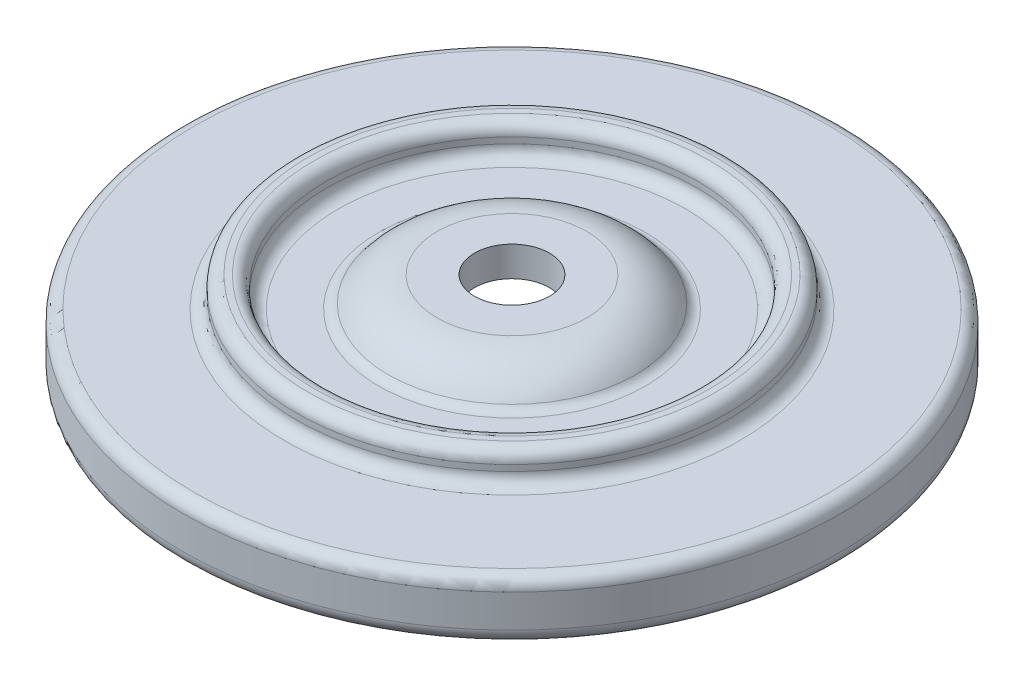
ISO-10303-21;
HEADER;
FILE_DESCRIPTION(('STEP AP214'),'2;1');
FILE_NAME('part.step','',(''),(''),'','','');
FILE_SCHEMA(('AUTOMOTIVE_DESIGN { 1 0 10303 214 1 1 1 1 }'));
ENDSEC;
DATA;
#1=APPLICATION_CONTEXT('core data for automotive mechanical design processes');
#2=APPLICATION_PROTOCOL_DEFINITION('international standard','automotive_design',2000,#1);
#3=PRODUCT_CONTEXT('',#1,'mechanical');
#4=PRODUCT('Part','Part','',(#3));
#5=PRODUCT_RELATED_PRODUCT_CATEGORY('part','',(#4));
#6=PRODUCT_DEFINITION_FORMATION('','',#4);
#7=PRODUCT_DEFINITION_CONTEXT('part definition',#1,'design');
#8=PRODUCT_DEFINITION('design','',#6,#7);
#9=PRODUCT_DEFINITION_SHAPE('','',#8);
#10=(LENGTH_UNIT() NAMED_UNIT(*) SI_UNIT(.MILLI.,.METRE.));
#11=(NAMED_UNIT(*) PLANE_ANGLE_UNIT() SI_UNIT($,.RADIAN.));
#12=(NAMED_UNIT(*) SI_UNIT($,.STERADIAN.) SOLID_ANGLE_UNIT());
#13=UNCERTAINTY_MEASURE_WITH_UNIT(LENGTH_MEASURE(1.E-05),#10,'distance_accuracy_value','');
#14=(GEOMETRIC_REPRESENTATION_CONTEXT(3) GLOBAL_UNCERTAINTY_ASSIGNED_CONTEXT((#13)) GLOBAL_UNIT_ASSIGNED_CONTEXT((#10,
#11,#12)) REPRESENTATION_CONTEXT('',''));
#15=CARTESIAN_POINT('',(0.,0.,0.));
#16=DIRECTION('',(0.,0.,1.));
#17=DIRECTION('',(1.,0.,0.));
#18=AXIS2_PLACEMENT_3D('',#15,#16,#17);
#19=CARTESIAN_POINT('',(13.97,-3.80999999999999,0.));
#20=DIRECTION('',(0.,1.,0.));
#21=DIRECTION('',(0.,0.,1.));
#22=AXIS2_PLACEMENT_3D('',#19,#20,#21);
#23=PLANE('',#22);
#24=CARTESIAN_POINT('',(0.,-3.80999999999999,0.));
#25=DIRECTION('',(0.,1.,0.));
#26=DIRECTION('',(0.,0.,1.));
#27=AXIS2_PLACEMENT_3D('',#24,#25,#26);
#28=CIRCLE('',#27,13.208);
#29=CARTESIAN_POINT('',(0.,-3.80999999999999,13.208));
#30=VERTEX_POINT('',#29);
#31=EDGE_CURVE('E82',#30,#30,#28,.T.);
#32=ORIENTED_EDGE('',*,*,#31,.T.);
#33=EDGE_LOOP('',(#32));
#34=FACE_BOUND('',#33,.T.);
#35=CARTESIAN_POINT('',(0.,-3.80999999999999,0.));
#36=DIRECTION('',(0.,1.,0.));
#37=DIRECTION('',(0.,0.,1.));
#38=AXIS2_PLACEMENT_3D('',#35,#36,#37);
#39=CIRCLE('',#38,13.335);
#40=CARTESIAN_POINT('',(0.,-3.80999999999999,13.335));
#41=VERTEX_POINT('',#40);
#42=EDGE_CURVE('E88',#41,#41,#39,.F.);
#43=ORIENTED_EDGE('',*,*,#42,.T.);
#44=EDGE_LOOP('',(#43));
#45=FACE_BOUND('',#44,.T.);
#46=ADVANCED_FACE('F26',(#34,#45),#23,.F.);
#47=CARTESIAN_POINT('',(0.,0.,0.));
#48=DIRECTION('',(0.,-1.,0.));
#49=DIRECTION('',(0.,0.,-1.));
#50=AXIS2_PLACEMENT_3D('',#47,#48,#49);
#51=PLANE('',#50);
#52=CARTESIAN_POINT('',(0.,0.,0.));
#53=DIRECTION('',(0.,-1.,0.));
#54=DIRECTION('',(0.,0.,-1.));
#55=AXIS2_PLACEMENT_3D('',#52,#53,#54);
#56=CIRCLE('',#55,8.636);
#57=CARTESIAN_POINT('',(0.,0.,-8.636));
#58=VERTEX_POINT('',#57);
#59=EDGE_CURVE('E49',#58,#58,#56,.F.);
#60=ORIENTED_EDGE('',*,*,#59,.T.);
#61=EDGE_LOOP('',(#60));
#62=FACE_BOUND('',#61,.T.);
#63=CARTESIAN_POINT('',(0.,0.,0.));
#64=DIRECTION('',(0.,-1.,0.));
#65=DIRECTION('',(0.,0.,-1.));
#66=AXIS2_PLACEMENT_3D('',#63,#64,#65);
#67=CIRCLE('',#66,8.382);
#68=CARTESIAN_POINT('',(0.,0.,-8.382));
#69=VERTEX_POINT('',#68);
#70=EDGE_CURVE('E52',#69,#69,#67,.T.);
#71=ORIENTED_EDGE('',*,*,#70,.T.);
#72=EDGE_LOOP('',(#71));
#73=FACE_BOUND('',#72,.T.);
#74=ADVANCED_FACE('F28',(#62,#73),#51,.F.);
#75=CARTESIAN_POINT('',(0.,0.,0.));
#76=DIRECTION('',(0.,-1.,0.));
#77=DIRECTION('',(0.,0.,-1.));
#78=AXIS2_PLACEMENT_3D('',#75,#76,#77);
#79=CYLINDRICAL_SURFACE('',#78,9.144);
#80=CARTESIAN_POINT('',(0.,-0.762,0.));
#81=DIRECTION('',(0.,-1.,0.));
#82=DIRECTION('',(0.,0.,-1.));
#83=AXIS2_PLACEMENT_3D('',#80,#81,#82);
#84=CIRCLE('',#83,9.144);
#85=CARTESIAN_POINT('',(0.,-0.762,-9.144));
#86=VERTEX_POINT('',#85);
#87=EDGE_CURVE('E58',#86,#86,#84,.F.);
#88=ORIENTED_EDGE('',*,*,#87,.T.);
#89=EDGE_LOOP('',(#88));
#90=FACE_BOUND('',#89,.T.);
#91=CARTESIAN_POINT('',(0.,-0.508,0.));
#92=DIRECTION('',(0.,-1.,0.));
#93=DIRECTION('',(0.,0.,-1.));
#94=AXIS2_PLACEMENT_3D('',#91,#92,#93);
#95=CIRCLE('',#94,9.144);
#96=CARTESIAN_POINT('',(0.,-0.508,-9.144));
#97=VERTEX_POINT('',#96);
#98=EDGE_CURVE('E61',#97,#97,#95,.T.);
#99=ORIENTED_EDGE('',*,*,#98,.T.);
#100=EDGE_LOOP('',(#99));
#101=FACE_BOUND('',#100,.T.);
#102=ADVANCED_FACE('F126',(#90,#101),#79,.T.);
#103=CARTESIAN_POINT('',(9.144,-1.27,0.));
#104=DIRECTION('',(0.,-1.,0.));
#105=DIRECTION('',(0.,0.,-1.));
#106=AXIS2_PLACEMENT_3D('',#103,#104,#105);
#107=PLANE('',#106);
#108=CARTESIAN_POINT('',(0.,-1.27,0.));
#109=DIRECTION('',(0.,-1.,0.));
#110=DIRECTION('',(0.,0.,-1.));
#111=AXIS2_PLACEMENT_3D('',#108,#109,#110);
#112=CIRCLE('',#111,9.652);
#113=CARTESIAN_POINT('',(0.,-1.27,-9.652));
#114=VERTEX_POINT('',#113);
#115=EDGE_CURVE('E64',#114,#114,#112,.T.);
#116=ORIENTED_EDGE('',*,*,#115,.T.);
#117=EDGE_LOOP('',(#116));
#118=FACE_BOUND('',#117,.T.);
#119=CARTESIAN_POINT('',(0.,-1.27,0.));
#120=DIRECTION('',(0.,-1.,0.));
#121=DIRECTION('',(0.,0.,-1.));
#122=AXIS2_PLACEMENT_3D('',#119,#120,#121);
#123=CIRCLE('',#122,13.462);
#124=CARTESIAN_POINT('',(0.,-1.27,-13.462));
#125=VERTEX_POINT('',#124);
#126=EDGE_CURVE('E67',#125,#125,#123,.F.);
#127=ORIENTED_EDGE('',*,*,#126,.T.);
#128=EDGE_LOOP('',(#127));
#129=FACE_BOUND('',#128,.T.);
#130=ADVANCED_FACE('F137',(#118,#129),#107,.F.);
#131=CARTESIAN_POINT('',(0.,0.,0.));
#132=DIRECTION('',(0.,-1.,0.));
#133=DIRECTION('',(0.,0.,-1.));
#134=AXIS2_PLACEMENT_3D('',#131,#132,#133);
#135=CYLINDRICAL_SURFACE('',#134,13.97);
#136=CARTESIAN_POINT('',(0.,-1.778,0.));
#137=DIRECTION('',(0.,-1.,0.));
#138=DIRECTION('',(0.,0.,-1.));
#139=AXIS2_PLACEMENT_3D('',#136,#137,#138);
#140=CIRCLE('',#139,13.97);
#141=CARTESIAN_POINT('',(0.,-1.778,-13.97));
#142=VERTEX_POINT('',#141);
#143=EDGE_CURVE('E55',#142,#142,#140,.T.);
#144=ORIENTED_EDGE('',*,*,#143,.T.);
#145=EDGE_LOOP('',(#144));
#146=FACE_BOUND('',#145,.T.);
#147=CARTESIAN_POINT('',(0.,-3.17499999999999,0.));
#148=DIRECTION('',(0.,1.,0.));
#149=DIRECTION('',(0.,0.,1.));
#150=AXIS2_PLACEMENT_3D('',#147,#148,#149);
#151=CIRCLE('',#150,13.97);
#152=CARTESIAN_POINT('',(0.,-3.17499999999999,13.97));
#153=VERTEX_POINT('',#152);
#154=EDGE_CURVE('E85',#153,#153,#151,.T.);
#155=ORIENTED_EDGE('',*,*,#154,.T.);
#156=EDGE_LOOP('',(#155));
#157=FACE_BOUND('',#156,.T.);
#158=ADVANCED_FACE('F134',(#146,#157),#135,.T.);
#159=CARTESIAN_POINT('',(0.,-2.54,0.));
#160=DIRECTION('',(0.,1.,0.));
#161=DIRECTION('',(0.,0.,1.));
#162=AXIS2_PLACEMENT_3D('',#159,#160,#161);
#163=TOROIDAL_SURFACE('',#162,3.175,2.54);
#164=CARTESIAN_POINT('',(0.,-1.05833333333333,0.));
#165=DIRECTION('',(0.,-1.,0.));
#166=DIRECTION('',(0.,0.,-1.));
#167=AXIS2_PLACEMENT_3D('',#164,#165,#166);
#168=CIRCLE('',#167,5.23807146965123);
#169=CARTESIAN_POINT('',(0.,-1.05833333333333,-5.23807146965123));
#170=VERTEX_POINT('',#169);
#171=EDGE_CURVE('E10',#170,#170,#168,.F.);
#172=ORIENTED_EDGE('',*,*,#171,.T.);
#173=EDGE_LOOP('',(#172));
#174=FACE_BOUND('',#173,.T.);
#175=CARTESIAN_POINT('',(0.,0.,0.));
#176=DIRECTION('',(0.,1.,0.));
#177=DIRECTION('',(0.,0.,1.));
#178=AXIS2_PLACEMENT_3D('',#175,#176,#177);
#179=CIRCLE('',#178,3.175);
#180=CARTESIAN_POINT('',(0.,0.,3.175));
#181=VERTEX_POINT('',#180);
#182=EDGE_CURVE('E91',#181,#181,#179,.T.);
#183=ORIENTED_EDGE('',*,*,#182,.F.);
#184=EDGE_LOOP('',(#183));
#185=FACE_BOUND('',#184,.T.);
#186=ADVANCED_FACE('F132',(#174,#185),#163,.T.);
#187=CARTESIAN_POINT('',(7.874,-1.27,0.));
#188=DIRECTION('',(0.,-1.,0.));
#189=DIRECTION('',(0.,0.,-1.));
#190=AXIS2_PLACEMENT_3D('',#187,#188,#189);
#191=PLANE('',#190);
#192=CARTESIAN_POINT('',(0.,-1.27,0.));
#193=DIRECTION('',(0.,-1.,0.));
#194=DIRECTION('',(0.,0.,-1.));
#195=AXIS2_PLACEMENT_3D('',#192,#193,#194);
#196=CIRCLE('',#195,7.366);
#197=CARTESIAN_POINT('',(0.,-1.27,-7.366));
#198=VERTEX_POINT('',#197);
#199=EDGE_CURVE('E34',#198,#198,#196,.F.);
#200=ORIENTED_EDGE('',*,*,#199,.T.);
#201=EDGE_LOOP('',(#200));
#202=FACE_BOUND('',#201,.T.);
#203=CARTESIAN_POINT('',(0.,-1.27,0.));
#204=DIRECTION('',(0.,-1.,0.));
#205=DIRECTION('',(0.,0.,-1.));
#206=AXIS2_PLACEMENT_3D('',#203,#204,#205);
#207=CIRCLE('',#206,5.65068576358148);
#208=CARTESIAN_POINT('',(0.,-1.27,-5.65068576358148));
#209=VERTEX_POINT('',#208);
#210=EDGE_CURVE('E38',#209,#209,#207,.T.);
#211=ORIENTED_EDGE('',*,*,#210,.T.);
#212=EDGE_LOOP('',(#211));
#213=FACE_BOUND('',#212,.T.);
#214=ADVANCED_FACE('F195',(#202,#213),#191,.F.);
#215=CARTESIAN_POINT('',(0.,0.,0.));
#216=DIRECTION('',(0.,1.,0.));
#217=DIRECTION('',(0.,0.,1.));
#218=AXIS2_PLACEMENT_3D('',#215,#216,#217);
#219=CYLINDRICAL_SURFACE('',#218,7.874);
#220=CARTESIAN_POINT('',(0.,-0.508,0.));
#221=DIRECTION('',(0.,-1.,0.));
#222=DIRECTION('',(0.,0.,-1.));
#223=AXIS2_PLACEMENT_3D('',#220,#221,#222);
#224=CIRCLE('',#223,7.874);
#225=CARTESIAN_POINT('',(0.,-0.508,-7.874));
#226=VERTEX_POINT('',#225);
#227=EDGE_CURVE('E43',#226,#226,#224,.F.);
#228=ORIENTED_EDGE('',*,*,#227,.T.);
#229=EDGE_LOOP('',(#228));
#230=FACE_BOUND('',#229,.T.);
#231=CARTESIAN_POINT('',(0.,-0.762,0.));
#232=DIRECTION('',(0.,-1.,0.));
#233=DIRECTION('',(0.,0.,-1.));
#234=AXIS2_PLACEMENT_3D('',#231,#232,#233);
#235=CIRCLE('',#234,7.874);
#236=CARTESIAN_POINT('',(0.,-0.762,-7.874));
#237=VERTEX_POINT('',#236);
#238=EDGE_CURVE('E46',#237,#237,#235,.T.);
#239=ORIENTED_EDGE('',*,*,#238,.T.);
#240=EDGE_LOOP('',(#239));
#241=FACE_BOUND('',#240,.T.);
#242=ADVANCED_FACE('F193',(#230,#241),#219,.F.);
#243=CARTESIAN_POINT('',(0.,0.,0.));
#244=DIRECTION('',(0.,1.,0.));
#245=DIRECTION('',(0.,0.,1.));
#246=AXIS2_PLACEMENT_3D('',#243,#244,#245);
#247=CIRCLE('',#246,1.5875);
#248=CARTESIAN_POINT('',(0.,0.,1.5875));
#249=VERTEX_POINT('',#248);
#250=EDGE_CURVE('E97',#249,#249,#247,.T.);
#251=ORIENTED_EDGE('',*,*,#250,.F.);
#252=EDGE_LOOP('',(#251));
#253=FACE_BOUND('',#252,.T.);
#254=ORIENTED_EDGE('',*,*,#182,.T.);
#255=EDGE_LOOP('',(#254));
#256=FACE_BOUND('',#255,.T.);
#257=ADVANCED_FACE('F128',(#253,#256),#51,.F.);
#258=CARTESIAN_POINT('',(0.,-1.27,0.));
#259=DIRECTION('',(0.,1.,0.));
#260=DIRECTION('',(0.,0.,1.));
#261=AXIS2_PLACEMENT_3D('',#258,#259,#260);
#262=PLANE('',#261);
#263=CARTESIAN_POINT('',(0.,-1.27,0.));
#264=DIRECTION('',(0.,1.,0.));
#265=DIRECTION('',(0.,0.,1.));
#266=AXIS2_PLACEMENT_3D('',#263,#264,#265);
#267=CIRCLE('',#266,1.5875);
#268=CARTESIAN_POINT('',(0.,-1.27,1.5875));
#269=VERTEX_POINT('',#268);
#270=EDGE_CURVE('E30',#269,#269,#267,.T.);
#271=ORIENTED_EDGE('',*,*,#270,.T.);
#272=EDGE_LOOP('',(#271));
#273=FACE_BOUND('',#272,.T.);
#274=CARTESIAN_POINT('',(0.,-1.27,0.));
#275=DIRECTION('',(0.,1.,0.));
#276=DIRECTION('',(0.,0.,1.));
#277=AXIS2_PLACEMENT_3D('',#274,#275,#276);
#278=CIRCLE('',#277,3.175);
#279=CARTESIAN_POINT('',(0.,-1.27,3.175));
#280=VERTEX_POINT('',#279);
#281=EDGE_CURVE('E94',#280,#280,#278,.T.);
#282=ORIENTED_EDGE('',*,*,#281,.F.);
#283=EDGE_LOOP('',(#282));
#284=FACE_BOUND('',#283,.T.);
#285=ADVANCED_FACE('F104',(#273,#284),#262,.F.);
#286=CARTESIAN_POINT('',(0.,-2.54,0.));
#287=DIRECTION('',(0.,1.,0.));
#288=DIRECTION('',(0.,0.,1.));
#289=AXIS2_PLACEMENT_3D('',#286,#287,#288);
#290=TOROIDAL_SURFACE('',#289,3.175,1.27);
#291=CARTESIAN_POINT('',(0.,-2.159,0.));
#292=DIRECTION('',(0.,-1.,0.));
#293=DIRECTION('',(0.,0.,-1.));
#294=AXIS2_PLACEMENT_3D('',#291,#292,#293);
#295=CIRCLE('',#294,4.38650278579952);
#296=CARTESIAN_POINT('',(0.,-2.159,-4.38650278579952));
#297=VERTEX_POINT('',#296);
#298=EDGE_CURVE('E70',#297,#297,#295,.T.);
#299=ORIENTED_EDGE('',*,*,#298,.T.);
#300=EDGE_LOOP('',(#299));
#301=FACE_BOUND('',#300,.T.);
#302=ORIENTED_EDGE('',*,*,#281,.T.);
#303=EDGE_LOOP('',(#302));
#304=FACE_BOUND('',#303,.T.);
#305=ADVANCED_FACE('F187',(#301,#304),#290,.F.);
#306=CARTESIAN_POINT('',(12.7,-3.048,0.));
#307=DIRECTION('',(0.,-1.,0.));
#308=DIRECTION('',(0.,0.,-1.));
#309=AXIS2_PLACEMENT_3D('',#306,#307,#308);
#310=PLANE('',#309);
#311=CARTESIAN_POINT('',(0.,-3.048,0.));
#312=DIRECTION('',(0.,-1.,0.));
#313=DIRECTION('',(0.,0.,-1.));
#314=AXIS2_PLACEMENT_3D('',#311,#312,#313);
#315=CIRCLE('',#314,5.59800557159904);
#316=CARTESIAN_POINT('',(0.,-3.048,-5.59800557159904));
#317=VERTEX_POINT('',#316);
#318=EDGE_CURVE('E73',#317,#317,#315,.F.);
#319=ORIENTED_EDGE('',*,*,#318,.T.);
#320=EDGE_LOOP('',(#319));
#321=FACE_BOUND('',#320,.T.);
#322=CARTESIAN_POINT('',(0.,-3.048,0.));
#323=DIRECTION('',(0.,-1.,0.));
#324=DIRECTION('',(0.,0.,-1.));
#325=AXIS2_PLACEMENT_3D('',#322,#323,#324);
#326=CIRCLE('',#325,12.2242622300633);
#327=CARTESIAN_POINT('',(0.,-3.048,-12.2242622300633));
#328=VERTEX_POINT('',#327);
#329=EDGE_CURVE('E76',#328,#328,#326,.T.);
#330=ORIENTED_EDGE('',*,*,#329,.T.);
#331=EDGE_LOOP('',(#330));
#332=FACE_BOUND('',#331,.T.);
#333=ADVANCED_FACE('F183',(#321,#332),#310,.T.);
#334=CARTESIAN_POINT('',(0.,-3.17499999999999,0.));
#335=DIRECTION('',(0.,1.,0.));
#336=DIRECTION('',(0.,0.,1.));
#337=AXIS2_PLACEMENT_3D('',#334,#335,#336);
#338=TOROIDAL_SURFACE('',#337,13.335,0.635);
#339=ORIENTED_EDGE('',*,*,#154,.F.);
#340=EDGE_LOOP('',(#339));
#341=FACE_BOUND('',#340,.T.);
#342=ORIENTED_EDGE('',*,*,#42,.F.);
#343=EDGE_LOOP('',(#342));
#344=FACE_BOUND('',#343,.T.);
#345=ADVANCED_FACE('F180',(#341,#344),#338,.T.);
#346=CARTESIAN_POINT('',(0.,-3.30199999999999,0.));
#347=DIRECTION('',(0.,1.,0.));
#348=DIRECTION('',(0.,0.,1.));
#349=AXIS2_PLACEMENT_3D('',#346,#347,#348);
#350=TOROIDAL_SURFACE('',#349,13.208,0.508);
#351=CARTESIAN_POINT('',(0.,-3.42900000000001,0.));
#352=DIRECTION('',(0.,1.,0.));
#353=DIRECTION('',(0.,0.,1.));
#354=AXIS2_PLACEMENT_3D('',#351,#352,#353);
#355=CIRCLE('',#354,12.7161311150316);
#356=CARTESIAN_POINT('',(0.,-3.42900000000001,12.7161311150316));
#357=VERTEX_POINT('',#356);
#358=EDGE_CURVE('E79',#357,#357,#355,.T.);
#359=ORIENTED_EDGE('',*,*,#358,.T.);
#360=EDGE_LOOP('',(#359));
#361=FACE_BOUND('',#360,.T.);
#362=ORIENTED_EDGE('',*,*,#31,.F.);
#363=EDGE_LOOP('',(#362));
#364=FACE_BOUND('',#363,.T.);
#365=ADVANCED_FACE('F177',(#361,#364),#350,.T.);
#366=CARTESIAN_POINT('',(0.,-3.556,0.));
#367=DIRECTION('',(0.,1.,0.));
#368=DIRECTION('',(0.,0.,1.));
#369=AXIS2_PLACEMENT_3D('',#366,#367,#368);
#370=TOROIDAL_SURFACE('',#369,12.2242622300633,0.508);
#371=ORIENTED_EDGE('',*,*,#329,.F.);
#372=EDGE_LOOP('',(#371));
#373=FACE_BOUND('',#372,.T.);
#374=ORIENTED_EDGE('',*,*,#358,.F.);
#375=EDGE_LOOP('',(#374));
#376=FACE_BOUND('',#375,.T.);
#377=ADVANCED_FACE('F173',(#373,#376),#370,.F.);
#378=CARTESIAN_POINT('',(0.,-1.778,0.));
#379=DIRECTION('',(0.,-1.,0.));
#380=DIRECTION('',(0.,0.,-1.));
#381=AXIS2_PLACEMENT_3D('',#378,#379,#380);
#382=TOROIDAL_SURFACE('',#381,5.59800557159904,1.27);
#383=ORIENTED_EDGE('',*,*,#298,.F.);
#384=EDGE_LOOP('',(#383));
#385=FACE_BOUND('',#384,.T.);
#386=ORIENTED_EDGE('',*,*,#318,.F.);
#387=EDGE_LOOP('',(#386));
#388=FACE_BOUND('',#387,.T.);
#389=ADVANCED_FACE('F169',(#385,#388),#382,.T.);
#390=CARTESIAN_POINT('',(0.,-0.762,0.));
#391=DIRECTION('',(0.,-1.,0.));
#392=DIRECTION('',(0.,0.,-1.));
#393=AXIS2_PLACEMENT_3D('',#390,#391,#392);
#394=TOROIDAL_SURFACE('',#393,9.652,0.508);
#395=ORIENTED_EDGE('',*,*,#87,.F.);
#396=EDGE_LOOP('',(#395));
#397=FACE_BOUND('',#396,.T.);
#398=ORIENTED_EDGE('',*,*,#115,.F.);
#399=EDGE_LOOP('',(#398));
#400=FACE_BOUND('',#399,.T.);
#401=ADVANCED_FACE('F161',(#397,#400),#394,.F.);
#402=CARTESIAN_POINT('',(0.,-1.778,0.));
#403=DIRECTION('',(0.,-1.,0.));
#404=DIRECTION('',(0.,0.,-1.));
#405=AXIS2_PLACEMENT_3D('',#402,#403,#404);
#406=TOROIDAL_SURFACE('',#405,13.462,0.508);
#407=ORIENTED_EDGE('',*,*,#126,.F.);
#408=EDGE_LOOP('',(#407));
#409=FACE_BOUND('',#408,.T.);
#410=ORIENTED_EDGE('',*,*,#143,.F.);
#411=EDGE_LOOP('',(#410));
#412=FACE_BOUND('',#411,.T.);
#413=ADVANCED_FACE('F152',(#409,#412),#406,.T.);
#414=CARTESIAN_POINT('',(0.,-0.508,0.));
#415=DIRECTION('',(0.,-1.,0.));
#416=DIRECTION('',(0.,0.,-1.));
#417=AXIS2_PLACEMENT_3D('',#414,#415,#416);
#418=TOROIDAL_SURFACE('',#417,8.636,0.508);
#419=ORIENTED_EDGE('',*,*,#59,.F.);
#420=EDGE_LOOP('',(#419));
#421=FACE_BOUND('',#420,.T.);
#422=ORIENTED_EDGE('',*,*,#98,.F.);
#423=EDGE_LOOP('',(#422));
#424=FACE_BOUND('',#423,.T.);
#425=ADVANCED_FACE('F149',(#421,#424),#418,.T.);
#426=CARTESIAN_POINT('',(0.,-0.508,0.));
#427=DIRECTION('',(0.,-1.,0.));
#428=DIRECTION('',(0.,0.,-1.));
#429=AXIS2_PLACEMENT_3D('',#426,#427,#428);
#430=TOROIDAL_SURFACE('',#429,8.382,0.508);
#431=ORIENTED_EDGE('',*,*,#70,.F.);
#432=EDGE_LOOP('',(#431));
#433=FACE_BOUND('',#432,.T.);
#434=ORIENTED_EDGE('',*,*,#227,.F.);
#435=EDGE_LOOP('',(#434));
#436=FACE_BOUND('',#435,.T.);
#437=ADVANCED_FACE('F151',(#433,#436),#430,.T.);
#438=CARTESIAN_POINT('',(0.,-0.762,0.));
#439=DIRECTION('',(0.,-1.,0.));
#440=DIRECTION('',(0.,0.,-1.));
#441=AXIS2_PLACEMENT_3D('',#438,#439,#440);
#442=TOROIDAL_SURFACE('',#441,7.366,0.508);
#443=ORIENTED_EDGE('',*,*,#238,.F.);
#444=EDGE_LOOP('',(#443));
#445=FACE_BOUND('',#444,.T.);
#446=ORIENTED_EDGE('',*,*,#199,.F.);
#447=EDGE_LOOP('',(#446));
#448=FACE_BOUND('',#447,.T.);
#449=ADVANCED_FACE('F115',(#445,#448),#442,.F.);
#450=CARTESIAN_POINT('',(0.,-0.762,0.));
#451=DIRECTION('',(0.,-1.,0.));
#452=DIRECTION('',(0.,0.,-1.));
#453=AXIS2_PLACEMENT_3D('',#450,#451,#452);
#454=TOROIDAL_SURFACE('',#453,5.65068576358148,0.508);
#455=ORIENTED_EDGE('',*,*,#210,.F.);
#456=EDGE_LOOP('',(#455));
#457=FACE_BOUND('',#456,.T.);
#458=ORIENTED_EDGE('',*,*,#171,.F.);
#459=EDGE_LOOP('',(#458));
#460=FACE_BOUND('',#459,.T.);
#461=ADVANCED_FACE('F109',(#457,#460),#454,.F.);
#462=CARTESIAN_POINT('',(0.,-3.80999999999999,0.));
#463=DIRECTION('',(0.,1.,0.));
#464=DIRECTION('',(0.,0.,1.));
#465=AXIS2_PLACEMENT_3D('',#462,#463,#464);
#466=CYLINDRICAL_SURFACE('',#465,1.5875);
#467=ORIENTED_EDGE('',*,*,#250,.T.);
#468=EDGE_LOOP('',(#467));
#469=FACE_BOUND('',#468,.T.);
#470=ORIENTED_EDGE('',*,*,#270,.F.);
#471=EDGE_LOOP('',(#470));
#472=FACE_BOUND('',#471,.T.);
#473=ADVANCED_FACE('F107',(#469,#472),#466,.F.);
#474=CLOSED_SHELL('',(#46,#74,#102,#130,#158,#186,#214,#242,#257,#285,#305,#333,#345,#365,#377,
#389,#401,#413,#425,#437,#449,#461,#473));
#475=MANIFOLD_SOLID_BREP('B2',#474);
#476=ADVANCED_BREP_SHAPE_REPRESENTATION('',(#18,#475),#14);
#477=SHAPE_DEFINITION_REPRESENTATION(#9,#476);
ENDSEC;
END-ISO-10303-21;
